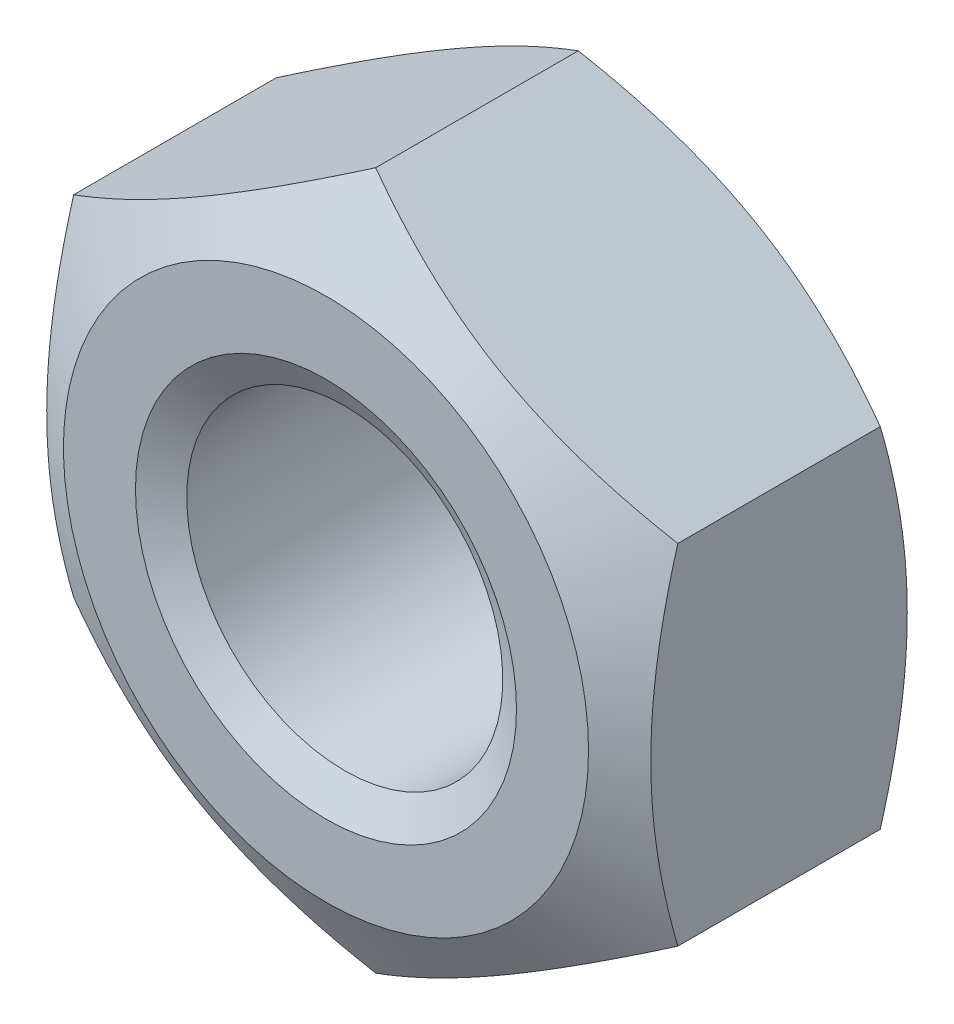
ISO-10303-21;
HEADER;
FILE_DESCRIPTION(('STEP AP214'),'2;1');
FILE_NAME('part.step','',(''),(''),'','','');
FILE_SCHEMA(('AUTOMOTIVE_DESIGN { 1 0 10303 214 1 1 1 1 }'));
ENDSEC;
DATA;
#1=APPLICATION_CONTEXT('core data for automotive mechanical design processes');
#2=APPLICATION_PROTOCOL_DEFINITION('international standard','automotive_design',2000,#1);
#3=PRODUCT_CONTEXT('',#1,'mechanical');
#4=PRODUCT('Part','Part','',(#3));
#5=PRODUCT_RELATED_PRODUCT_CATEGORY('part','',(#4));
#6=PRODUCT_DEFINITION_FORMATION('','',#4);
#7=PRODUCT_DEFINITION_CONTEXT('part definition',#1,'design');
#8=PRODUCT_DEFINITION('design','',#6,#7);
#9=PRODUCT_DEFINITION_SHAPE('','',#8);
#10=(LENGTH_UNIT() NAMED_UNIT(*) SI_UNIT(.MILLI.,.METRE.));
#11=(NAMED_UNIT(*) PLANE_ANGLE_UNIT() SI_UNIT($,.RADIAN.));
#12=(NAMED_UNIT(*) SI_UNIT($,.STERADIAN.) SOLID_ANGLE_UNIT());
#13=UNCERTAINTY_MEASURE_WITH_UNIT(LENGTH_MEASURE(1.E-05),#10,'distance_accuracy_value','');
#14=(GEOMETRIC_REPRESENTATION_CONTEXT(3) GLOBAL_UNCERTAINTY_ASSIGNED_CONTEXT((#13)) GLOBAL_UNIT_ASSIGNED_CONTEXT((#10,
#11,#12)) REPRESENTATION_CONTEXT('',''));
#15=CARTESIAN_POINT('',(0.,0.,0.));
#16=DIRECTION('',(0.,0.,1.));
#17=DIRECTION('',(1.,0.,0.));
#18=AXIS2_PLACEMENT_3D('',#15,#16,#17);
#19=CARTESIAN_POINT('',(0.,0.,0.));
#20=DIRECTION('',(0.,0.,1.));
#21=DIRECTION('',(1.,0.,0.));
#22=AXIS2_PLACEMENT_3D('',#19,#20,#21);
#23=PLANE('',#22);
#24=CARTESIAN_POINT('',(0.,0.,0.));
#25=DIRECTION('',(0.,0.,1.));
#26=DIRECTION('',(0.,-1.,0.));
#27=AXIS2_PLACEMENT_3D('',#24,#25,#26);
#28=CIRCLE('',#27,4.10000000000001);
#29=CARTESIAN_POINT('',(0.,-4.10000000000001,0.));
#30=VERTEX_POINT('',#29);
#31=EDGE_CURVE('E266',#30,#30,#28,.T.);
#32=ORIENTED_EDGE('',*,*,#31,.F.);
#33=EDGE_LOOP('',(#32));
#34=FACE_BOUND('',#33,.T.);
#35=CARTESIAN_POINT('',(0.,0.,0.));
#36=DIRECTION('',(0.,0.,1.));
#37=DIRECTION('',(1.,0.,0.));
#38=AXIS2_PLACEMENT_3D('',#35,#36,#37);
#39=CIRCLE('',#38,5.65);
#40=CARTESIAN_POINT('',(5.65,0.,0.));
#41=VERTEX_POINT('',#40);
#42=EDGE_CURVE('E225',#41,#41,#39,.T.);
#43=ORIENTED_EDGE('',*,*,#42,.T.);
#44=EDGE_LOOP('',(#43));
#45=FACE_BOUND('',#44,.T.);
#46=ADVANCED_FACE('F38',(#34,#45),#23,.T.);
#47=CARTESIAN_POINT('',(0.,0.,0.));
#48=DIRECTION('',(0.,0.,-1.));
#49=DIRECTION('',(-1.,0.,0.));
#50=AXIS2_PLACEMENT_3D('',#47,#48,#49);
#51=CONICAL_SURFACE('',#50,5.65,1.0471975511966);
#52=CARTESIAN_POINT('',(-6.50020000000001,3.75266127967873,-1.07137098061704));
#53=CARTESIAN_POINT('',(-6.35732254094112,3.8351516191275,-1.02375215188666));
#54=CARTESIAN_POINT('',(-6.21391236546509,3.91794952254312,-0.978294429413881));
#55=CARTESIAN_POINT('',(-5.92592736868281,4.08421773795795,-0.892296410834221));
#56=CARTESIAN_POINT('',(-5.78135207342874,4.16768832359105,-0.8517582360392));
#57=CARTESIAN_POINT('',(-5.34531134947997,4.41943655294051,-0.738318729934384));
#58=CARTESIAN_POINT('',(-5.05212471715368,4.58870793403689,-0.673795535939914));
#59=CARTESIAN_POINT('',(-4.61337625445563,4.84201947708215,-0.598134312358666));
#60=CARTESIAN_POINT('',(-4.46912536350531,4.92530276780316,-0.576580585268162));
#61=CARTESIAN_POINT('',(-4.17997178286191,5.09224566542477,-0.540438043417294));
#62=CARTESIAN_POINT('',(-4.03506915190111,5.17590523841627,-0.525848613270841));
#63=CARTESIAN_POINT('',(-3.74501222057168,5.34336968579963,-0.504006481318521));
#64=CARTESIAN_POINT('',(-3.59985839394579,5.427174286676,-0.496745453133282));
#65=CARTESIAN_POINT('',(-3.30942466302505,5.59485627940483,-0.489708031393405));
#66=CARTESIAN_POINT('',(-3.16414476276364,5.6787336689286,-0.489931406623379));
#67=CARTESIAN_POINT('',(-2.76612405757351,5.90853103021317,-0.500831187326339));
#68=CARTESIAN_POINT('',(-2.51351353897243,6.05437578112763,-0.519129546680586));
#69=CARTESIAN_POINT('',(-2.00997032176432,6.34509659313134,-0.577154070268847));
#70=CARTESIAN_POINT('',(-1.75903939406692,6.48997163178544,-0.616900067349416));
#71=CARTESIAN_POINT('',(-1.25448277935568,6.78127752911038,-0.71625363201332));
#72=CARTESIAN_POINT('',(-1.00092075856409,6.92767163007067,-0.776282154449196));
#73=CARTESIAN_POINT('',(-0.497578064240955,7.21827667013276,-0.912522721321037));
#74=CARTESIAN_POINT('',(-0.247790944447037,7.36249133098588,-0.988702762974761));
#75=CARTESIAN_POINT('',(0.000199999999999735,7.50566896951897,-1.07137098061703));
#76=B_SPLINE_CURVE_WITH_KNOTS('',3,(#52,#53,#54,#55,#56,#57,#58,#59,#60,#61,#62,#63,#64,#65,#66,
#67,#68,#69,#70,#71,#72,#73,#74,#75),.UNSPECIFIED.,.F.,.F.,(4,2,2,2,2,2,2,2,2,2,2,4),(0.,
0.515105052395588,1.03043143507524,2.06322554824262,2.56697389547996,3.07067772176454,
3.57380860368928,4.0769239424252,4.9527935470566,5.82947446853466,6.72559912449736,
7.61996451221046),.UNSPECIFIED.);
#77=CARTESIAN_POINT('',(-6.5,3.75277674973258,-1.07130431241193));
#78=VERTEX_POINT('',#77);
#79=CARTESIAN_POINT('',(0.,7.50555349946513,-1.07130431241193));
#80=VERTEX_POINT('',#79);
#81=EDGE_CURVE('E220',#78,#80,#76,.T.);
#82=ORIENTED_EDGE('',*,*,#81,.F.);
#83=CARTESIAN_POINT('',(-6.50000000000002,-9.88501104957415,-3.56837954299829));
#84=CARTESIAN_POINT('',(-6.50000000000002,-9.60267290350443,-3.432217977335));
#85=CARTESIAN_POINT('',(-6.50000000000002,-9.31966517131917,-3.29741992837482));
#86=CARTESIAN_POINT('',(-6.50000000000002,-8.75195359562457,-3.03132204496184));
#87=CARTESIAN_POINT('',(-6.50000000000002,-8.46724947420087,-2.90002280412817));
#88=CARTESIAN_POINT('',(-6.50000000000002,-7.89422527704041,-2.64099072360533));
#89=CARTESIAN_POINT('',(-6.50000000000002,-7.6058938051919,-2.51328300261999));
#90=CARTESIAN_POINT('',(-6.50000000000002,-7.02686778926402,-2.26336264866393));
#91=CARTESIAN_POINT('',(-6.50000000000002,-6.73617336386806,-2.14114974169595));
#92=CARTESIAN_POINT('',(-6.50000000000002,-6.1434030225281,-1.90019881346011));
#93=CARTESIAN_POINT('',(-6.50000000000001,-5.84124284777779,-1.78166688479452));
#94=CARTESIAN_POINT('',(-6.50000000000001,-5.23331686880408,-1.55405656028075));
#95=CARTESIAN_POINT('',(-6.50000000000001,-4.92755065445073,-1.44497925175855));
#96=CARTESIAN_POINT('',(-6.50000000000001,-4.31256079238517,-1.23928610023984));
#97=CARTESIAN_POINT('',(-6.50000000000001,-4.00334628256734,-1.14264324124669));
#98=CARTESIAN_POINT('',(-6.50000000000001,-3.38049972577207,-0.965045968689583));
#99=CARTESIAN_POINT('',(-6.50000000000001,-3.06686916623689,-0.884086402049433));
#100=CARTESIAN_POINT('',(-6.50000000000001,-2.4366401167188,-0.742287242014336));
#101=CARTESIAN_POINT('',(-6.50000000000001,-2.12006479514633,-0.681347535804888));
#102=CARTESIAN_POINT('',(-6.50000000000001,-1.64248174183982,-0.607688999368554));
#103=CARTESIAN_POINT('',(-6.50000000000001,-1.48282059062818,-0.586093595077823));
#104=CARTESIAN_POINT('',(-6.50000000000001,-1.16277367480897,-0.549247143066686));
#105=CARTESIAN_POINT('',(-6.50000000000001,-1.00238798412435,-0.533995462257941));
#106=CARTESIAN_POINT('',(-6.50000000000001,-0.683113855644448,-0.510321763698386));
#107=CARTESIAN_POINT('',(-6.50000000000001,-0.524231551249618,-0.501817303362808));
#108=CARTESIAN_POINT('',(-6.50000000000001,-0.206250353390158,-0.49151790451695));
#109=CARTESIAN_POINT('',(-6.50000000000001,-0.0471514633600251,-0.489722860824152));
#110=CARTESIAN_POINT('',(-6.50000000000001,0.270981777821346,-0.492885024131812));
#111=CARTESIAN_POINT('',(-6.50000000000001,0.430016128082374,-0.497842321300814));
#112=CARTESIAN_POINT('',(-6.50000000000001,0.747741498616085,-0.51439211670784));
#113=CARTESIAN_POINT('',(-6.50000000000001,0.906432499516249,-0.525984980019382));
#114=CARTESIAN_POINT('',(-6.50000000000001,1.29391310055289,-0.562155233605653));
#115=CARTESIAN_POINT('',(-6.50000000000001,1.52238353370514,-0.590218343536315));
#116=CARTESIAN_POINT('',(-6.50000000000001,1.97748684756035,-0.658520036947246));
#117=CARTESIAN_POINT('',(-6.50000000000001,2.20411944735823,-0.698760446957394));
#118=CARTESIAN_POINT('',(-6.50000000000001,2.88108028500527,-0.835601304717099));
#119=CARTESIAN_POINT('',(-6.50000000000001,3.32819122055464,-0.948291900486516));
#120=CARTESIAN_POINT('',(-6.50000000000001,3.99654941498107,-1.14191658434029));
#121=CARTESIAN_POINT('',(-6.50000000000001,4.22130458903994,-1.21142333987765));
#122=CARTESIAN_POINT('',(-6.50000000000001,4.66863001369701,-1.35720683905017));
#123=CARTESIAN_POINT('',(-6.50000000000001,4.89120025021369,-1.43348362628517));
#124=CARTESIAN_POINT('',(-6.50000000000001,5.33423505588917,-1.59162107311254));
#125=CARTESIAN_POINT('',(-6.5,5.55470038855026,-1.67347961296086));
#126=CARTESIAN_POINT('',(-6.5,5.99383484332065,-1.84186249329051));
#127=CARTESIAN_POINT('',(-6.5,6.21250398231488,-1.92838678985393));
#128=CARTESIAN_POINT('',(-6.5,6.71023613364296,-2.13048562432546));
#129=CARTESIAN_POINT('',(-6.5,6.98878541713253,-2.24732271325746));
#130=CARTESIAN_POINT('',(-6.5,7.54369190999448,-2.48610412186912));
#131=CARTESIAN_POINT('',(-6.5,7.82004901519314,-2.60804868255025));
#132=CARTESIAN_POINT('',(-6.5,8.37095551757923,-2.85606282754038));
#133=CARTESIAN_POINT('',(-6.5,8.64550461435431,-2.98213307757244));
#134=CARTESIAN_POINT('',(-6.5,9.19304534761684,-3.23761606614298));
#135=CARTESIAN_POINT('',(-6.5,9.46603695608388,-3.36702886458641));
#136=CARTESIAN_POINT('',(-6.5,10.2835096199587,-3.75956855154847));
#137=CARTESIAN_POINT('',(-6.5,10.8260256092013,-4.02678573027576));
#138=CARTESIAN_POINT('',(-6.5,11.9072962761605,-4.56872328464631));
#139=CARTESIAN_POINT('',(-6.5,12.4460508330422,-4.84344389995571));
#140=CARTESIAN_POINT('',(-6.5,13.2311434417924,-5.24876750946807));
#141=CARTESIAN_POINT('',(-6.5,13.4785832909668,-5.37724244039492));
#142=CARTESIAN_POINT('',(-6.5,13.9729354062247,-5.6351936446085));
#143=CARTESIAN_POINT('',(-6.5,14.219847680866,-5.76466990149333));
#144=CARTESIAN_POINT('',(-6.5,14.959914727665,-6.15441208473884));
#145=CARTESIAN_POINT('',(-6.5,15.4523825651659,-6.4159825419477));
#146=CARTESIAN_POINT('',(-6.49999999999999,16.4348369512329,-6.94123007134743));
#147=CARTESIAN_POINT('',(-6.49999999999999,16.9248265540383,-7.20490144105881));
#148=CARTESIAN_POINT('',(-6.49999999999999,17.9036341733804,-7.73435554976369));
#149=CARTESIAN_POINT('',(-6.49999999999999,18.3924522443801,-8.00013818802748));
#150=CARTESIAN_POINT('',(-6.49999999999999,18.8808336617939,-8.26671592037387));
#151=B_SPLINE_CURVE_WITH_KNOTS('',3,(#83,#84,#85,#86,#87,#88,#89,#90,#91,#92,#93,#94,#95,#96,
#97,#98,#99,#100,#101,#102,#103,#104,#105,#106,#107,#108,#109,#110,#111,#112,#113,#114,#115,
#116,#117,#118,#119,#120,#121,#122,#123,#124,#125,#126,#127,#128,#129,#130,#131,#132,#133,#134,
#135,#136,#137,#138,#139,#140,#141,#142,#143,#144,#145,#146,#147,#148,#149,#150),.UNSPECIFIED.,
.F.,.F.,(4,2,2,2,2,2,2,2,2,2,2,2,2,2,2,2,2,2,2,2,2,2,2,2,2,2,2,2,2,2,2,2,2,4),(0.,
0.940381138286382,1.88092082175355,2.82691871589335,3.7728693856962,4.74647944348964,
5.72020132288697,6.69177055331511,7.66302001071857,8.62933589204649,9.11257459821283,
9.59576506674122,10.0729564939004,10.5501404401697,11.0273307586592,11.5045473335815,
12.1947157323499,12.8849877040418,14.2663735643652,14.9720931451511,15.6778172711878,
16.3832748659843,17.0887258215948,17.994840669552,18.9009983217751,19.8073029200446,
20.7136237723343,22.5277913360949,24.3420169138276,25.17843035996,26.0148301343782,
27.6876876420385,29.3569670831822,31.0261673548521),.UNSPECIFIED.);
#152=CARTESIAN_POINT('',(-6.50000000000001,-3.75277674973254,-1.07130431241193));
#153=VERTEX_POINT('',#152);
#154=EDGE_CURVE('E188',#153,#78,#151,.T.);
#155=ORIENTED_EDGE('',*,*,#154,.F.);
#156=CARTESIAN_POINT('',(0.000199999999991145,-7.50566896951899,-1.07137098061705));
#157=CARTESIAN_POINT('',(-0.14267745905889,-7.42317863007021,-1.02375215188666));
#158=CARTESIAN_POINT('',(-0.286087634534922,-7.34038072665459,-0.978294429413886));
#159=CARTESIAN_POINT('',(-0.574072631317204,-7.17411251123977,-0.892296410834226));
#160=CARTESIAN_POINT('',(-0.718647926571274,-7.09064192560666,-0.851758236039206));
#161=CARTESIAN_POINT('',(-1.15468865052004,-6.8388936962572,-0.73831872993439));
#162=CARTESIAN_POINT('',(-1.44787528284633,-6.66962231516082,-0.673795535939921));
#163=CARTESIAN_POINT('',(-1.88662374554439,-6.41631077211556,-0.598134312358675));
#164=CARTESIAN_POINT('',(-2.0308746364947,-6.33302748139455,-0.576580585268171));
#165=CARTESIAN_POINT('',(-2.3200282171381,-6.16608458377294,-0.540438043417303));
#166=CARTESIAN_POINT('',(-2.4649308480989,-6.08242501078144,-0.525848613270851));
#167=CARTESIAN_POINT('',(-2.75498777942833,-5.91496056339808,-0.504006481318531));
#168=CARTESIAN_POINT('',(-2.90014160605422,-5.83115596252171,-0.496745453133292));
#169=CARTESIAN_POINT('',(-3.19057533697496,-5.66347396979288,-0.489708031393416));
#170=CARTESIAN_POINT('',(-3.33585523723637,-5.57959658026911,-0.48993140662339));
#171=CARTESIAN_POINT('',(-3.73387594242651,-5.34979921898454,-0.500831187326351));
#172=CARTESIAN_POINT('',(-3.98648646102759,-5.20395446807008,-0.519129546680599));
#173=CARTESIAN_POINT('',(-4.49002967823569,-4.91323365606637,-0.57715407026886));
#174=CARTESIAN_POINT('',(-4.7409606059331,-4.76835861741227,-0.616900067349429));
#175=CARTESIAN_POINT('',(-5.24551722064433,-4.47705272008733,-0.716253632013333));
#176=CARTESIAN_POINT('',(-5.49907924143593,-4.33065861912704,-0.77628215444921));
#177=CARTESIAN_POINT('',(-6.00242193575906,-4.04005357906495,-0.912522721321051));
#178=CARTESIAN_POINT('',(-6.25220905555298,-3.89583891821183,-0.988702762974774));
#179=CARTESIAN_POINT('',(-6.50020000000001,-3.75266127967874,-1.07137098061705));
#180=B_SPLINE_CURVE_WITH_KNOTS('',3,(#156,#157,#158,#159,#160,#161,#162,#163,#164,#165,#166,
#167,#168,#169,#170,#171,#172,#173,#174,#175,#176,#177,#178,#179),.UNSPECIFIED.,.F.,.F.,(4,2,2,
2,2,2,2,2,2,2,2,4),(0.,0.515105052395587,1.03043143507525,2.06322554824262,2.56697389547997,
3.07067772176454,3.57380860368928,4.0769239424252,4.9527935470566,5.82947446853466,
6.72559912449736,7.61996451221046),.UNSPECIFIED.);
#181=CARTESIAN_POINT('',(0.,-7.50555349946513,-1.07130431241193));
#182=VERTEX_POINT('',#181);
#183=EDGE_CURVE('E180',#182,#153,#180,.T.);
#184=ORIENTED_EDGE('',*,*,#183,.F.);
#185=CARTESIAN_POINT('',(6.50019999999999,-3.75266127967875,-1.07137098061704));
#186=CARTESIAN_POINT('',(6.35732254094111,-3.83515161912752,-1.02375215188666));
#187=CARTESIAN_POINT('',(6.21391236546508,-3.91794952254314,-0.978294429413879));
#188=CARTESIAN_POINT('',(5.9259273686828,-4.08421773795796,-0.89229641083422));
#189=CARTESIAN_POINT('',(5.78135207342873,-4.16768832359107,-0.8517582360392));
#190=CARTESIAN_POINT('',(5.34531134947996,-4.41943655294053,-0.738318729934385));
#191=CARTESIAN_POINT('',(5.05212471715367,-4.58870793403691,-0.673795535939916));
#192=CARTESIAN_POINT('',(4.61337625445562,-4.84201947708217,-0.598134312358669));
#193=CARTESIAN_POINT('',(4.4691253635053,-4.92530276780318,-0.576580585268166));
#194=CARTESIAN_POINT('',(4.1799717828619,-5.09224566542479,-0.540438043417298));
#195=CARTESIAN_POINT('',(4.0350691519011,-5.17590523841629,-0.525848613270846));
#196=CARTESIAN_POINT('',(3.74501222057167,-5.34336968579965,-0.504006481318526));
#197=CARTESIAN_POINT('',(3.59985839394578,-5.42717428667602,-0.496745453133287));
#198=CARTESIAN_POINT('',(3.30942466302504,-5.59485627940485,-0.489708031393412));
#199=CARTESIAN_POINT('',(3.16414476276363,-5.67873366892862,-0.489931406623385));
#200=CARTESIAN_POINT('',(2.7661240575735,-5.90853103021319,-0.500831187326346));
#201=CARTESIAN_POINT('',(2.51351353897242,-6.05437578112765,-0.519129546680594));
#202=CARTESIAN_POINT('',(2.00997032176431,-6.34509659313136,-0.577154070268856));
#203=CARTESIAN_POINT('',(1.75903939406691,-6.48997163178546,-0.616900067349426));
#204=CARTESIAN_POINT('',(1.25448277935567,-6.7812775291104,-0.71625363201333));
#205=CARTESIAN_POINT('',(1.00092075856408,-6.92767163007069,-0.776282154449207));
#206=CARTESIAN_POINT('',(0.497578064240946,-7.21827667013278,-0.912522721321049));
#207=CARTESIAN_POINT('',(0.247790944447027,-7.3624913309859,-0.988702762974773));
#208=CARTESIAN_POINT('',(-0.000200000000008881,-7.50566896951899,-1.07137098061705));
#209=B_SPLINE_CURVE_WITH_KNOTS('',3,(#185,#186,#187,#188,#189,#190,#191,#192,#193,#194,#195,
#196,#197,#198,#199,#200,#201,#202,#203,#204,#205,#206,#207,#208),.UNSPECIFIED.,.F.,.F.,(4,2,2,
2,2,2,2,2,2,2,2,4),(0.,0.515105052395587,1.03043143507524,2.06322554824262,2.56697389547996,
3.07067772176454,3.57380860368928,4.0769239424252,4.9527935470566,5.82947446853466,
6.72559912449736,7.61996451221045),.UNSPECIFIED.);
#210=CARTESIAN_POINT('',(6.49999999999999,-3.75277674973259,-1.07130431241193));
#211=VERTEX_POINT('',#210);
#212=EDGE_CURVE('E96',#211,#182,#209,.T.);
#213=ORIENTED_EDGE('',*,*,#212,.F.);
#214=CARTESIAN_POINT('',(6.5,-9.88501104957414,-3.56837954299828));
#215=CARTESIAN_POINT('',(6.5,-9.60267290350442,-3.43221797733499));
#216=CARTESIAN_POINT('',(6.5,-9.31966517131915,-3.29741992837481));
#217=CARTESIAN_POINT('',(6.5,-8.75195359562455,-3.03132204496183));
#218=CARTESIAN_POINT('',(6.5,-8.46724947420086,-2.90002280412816));
#219=CARTESIAN_POINT('',(6.5,-7.8942252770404,-2.64099072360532));
#220=CARTESIAN_POINT('',(6.5,-7.60589380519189,-2.51328300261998));
#221=CARTESIAN_POINT('',(6.5,-7.02686778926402,-2.26336264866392));
#222=CARTESIAN_POINT('',(6.5,-6.73617336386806,-2.14114974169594));
#223=CARTESIAN_POINT('',(6.5,-6.1434030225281,-1.9001988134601));
#224=CARTESIAN_POINT('',(6.5,-5.84124284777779,-1.78166688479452));
#225=CARTESIAN_POINT('',(6.49999999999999,-5.23331686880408,-1.55405656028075));
#226=CARTESIAN_POINT('',(6.49999999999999,-4.92755065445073,-1.44497925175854));
#227=CARTESIAN_POINT('',(6.49999999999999,-4.31256079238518,-1.23928610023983));
#228=CARTESIAN_POINT('',(6.49999999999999,-4.00334628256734,-1.14264324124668));
#229=CARTESIAN_POINT('',(6.49999999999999,-3.38049972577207,-0.965045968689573));
#230=CARTESIAN_POINT('',(6.49999999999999,-3.06686916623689,-0.884086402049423));
#231=CARTESIAN_POINT('',(6.49999999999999,-2.4366401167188,-0.742287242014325));
#232=CARTESIAN_POINT('',(6.49999999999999,-2.12006479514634,-0.681347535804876));
#233=CARTESIAN_POINT('',(6.49999999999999,-1.64248174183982,-0.607688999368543));
#234=CARTESIAN_POINT('',(6.49999999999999,-1.48282059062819,-0.586093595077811));
#235=CARTESIAN_POINT('',(6.49999999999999,-1.16277367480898,-0.549247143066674));
#236=CARTESIAN_POINT('',(6.49999999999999,-1.00238798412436,-0.533995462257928));
#237=CARTESIAN_POINT('',(6.49999999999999,-0.683113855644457,-0.510321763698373));
#238=CARTESIAN_POINT('',(6.49999999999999,-0.524231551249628,-0.501817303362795));
#239=CARTESIAN_POINT('',(6.49999999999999,-0.206250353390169,-0.491517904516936));
#240=CARTESIAN_POINT('',(6.49999999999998,-0.0471514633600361,-0.489722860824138));
#241=CARTESIAN_POINT('',(6.49999999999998,0.270981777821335,-0.492885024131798));
#242=CARTESIAN_POINT('',(6.49999999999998,0.430016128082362,-0.4978423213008));
#243=CARTESIAN_POINT('',(6.49999999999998,0.747741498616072,-0.514392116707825));
#244=CARTESIAN_POINT('',(6.49999999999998,0.906432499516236,-0.525984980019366));
#245=CARTESIAN_POINT('',(6.49999999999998,1.29391310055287,-0.562155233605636));
#246=CARTESIAN_POINT('',(6.49999999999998,1.52238353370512,-0.590218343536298));
#247=CARTESIAN_POINT('',(6.49999999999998,1.97748684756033,-0.658520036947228));
#248=CARTESIAN_POINT('',(6.49999999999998,2.20411944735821,-0.698760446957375));
#249=CARTESIAN_POINT('',(6.49999999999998,2.88108028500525,-0.835601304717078));
#250=CARTESIAN_POINT('',(6.49999999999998,3.32819122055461,-0.948291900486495));
#251=CARTESIAN_POINT('',(6.49999999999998,3.99654941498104,-1.14191658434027));
#252=CARTESIAN_POINT('',(6.49999999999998,4.22130458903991,-1.21142333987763));
#253=CARTESIAN_POINT('',(6.49999999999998,4.66863001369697,-1.35720683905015));
#254=CARTESIAN_POINT('',(6.49999999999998,4.89120025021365,-1.43348362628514));
#255=CARTESIAN_POINT('',(6.49999999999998,5.33423505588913,-1.59162107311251));
#256=CARTESIAN_POINT('',(6.49999999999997,5.55470038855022,-1.67347961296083));
#257=CARTESIAN_POINT('',(6.49999999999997,5.99383484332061,-1.84186249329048));
#258=CARTESIAN_POINT('',(6.49999999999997,6.21250398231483,-1.9283867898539));
#259=CARTESIAN_POINT('',(6.49999999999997,6.71023613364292,-2.13048562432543));
#260=CARTESIAN_POINT('',(6.49999999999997,6.98878541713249,-2.24732271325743));
#261=CARTESIAN_POINT('',(6.49999999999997,7.54369190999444,-2.48610412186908));
#262=CARTESIAN_POINT('',(6.49999999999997,7.8200490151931,-2.60804868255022));
#263=CARTESIAN_POINT('',(6.49999999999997,8.37095551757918,-2.85606282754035));
#264=CARTESIAN_POINT('',(6.49999999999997,8.64550461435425,-2.98213307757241));
#265=CARTESIAN_POINT('',(6.49999999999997,9.19304534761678,-3.23761606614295));
#266=CARTESIAN_POINT('',(6.49999999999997,9.46603695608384,-3.36702886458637));
#267=CARTESIAN_POINT('',(6.49999999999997,10.2835096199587,-3.75956855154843));
#268=CARTESIAN_POINT('',(6.49999999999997,10.8260256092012,-4.02678573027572));
#269=CARTESIAN_POINT('',(6.49999999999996,11.9072962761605,-4.56872328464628));
#270=CARTESIAN_POINT('',(6.49999999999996,12.4460508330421,-4.84344389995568));
#271=CARTESIAN_POINT('',(6.49999999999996,13.2311434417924,-5.24876750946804));
#272=CARTESIAN_POINT('',(6.49999999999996,13.4785832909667,-5.37724244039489));
#273=CARTESIAN_POINT('',(6.49999999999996,13.9729354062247,-5.63519364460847));
#274=CARTESIAN_POINT('',(6.49999999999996,14.2198476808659,-5.7646699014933));
#275=CARTESIAN_POINT('',(6.49999999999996,14.959914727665,-6.1544120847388));
#276=CARTESIAN_POINT('',(6.49999999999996,15.4523825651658,-6.41598254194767));
#277=CARTESIAN_POINT('',(6.49999999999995,16.4348369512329,-6.9412300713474));
#278=CARTESIAN_POINT('',(6.49999999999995,16.9248265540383,-7.20490144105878));
#279=CARTESIAN_POINT('',(6.49999999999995,17.9036341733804,-7.73435554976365));
#280=CARTESIAN_POINT('',(6.49999999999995,18.3924522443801,-8.00013818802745));
#281=CARTESIAN_POINT('',(6.49999999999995,18.8808336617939,-8.26671592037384));
#282=B_SPLINE_CURVE_WITH_KNOTS('',3,(#214,#215,#216,#217,#218,#219,#220,#221,#222,#223,#224,
#225,#226,#227,#228,#229,#230,#231,#232,#233,#234,#235,#236,#237,#238,#239,#240,#241,#242,#243,
#244,#245,#246,#247,#248,#249,#250,#251,#252,#253,#254,#255,#256,#257,#258,#259,#260,#261,#262,
#263,#264,#265,#266,#267,#268,#269,#270,#271,#272,#273,#274,#275,#276,#277,#278,#279,#280,#281),
.UNSPECIFIED.,.F.,.F.,(4,2,2,2,2,2,2,2,2,2,2,2,2,2,2,2,2,2,2,2,2,2,2,2,2,2,2,2,2,2,2,2,2,4),(0.,
0.940381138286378,1.88092082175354,2.82691871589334,3.77286938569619,4.74647944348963,
5.72020132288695,6.69177055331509,7.66302001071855,8.62933589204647,9.11257459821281,
9.5957650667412,10.0729564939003,10.5501404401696,11.0273307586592,11.5045473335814,
12.1947157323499,12.8849877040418,14.2663735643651,14.9720931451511,15.6778172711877,
16.3832748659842,17.0887258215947,17.9948406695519,18.9009983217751,19.8073029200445,
20.7136237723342,22.5277913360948,24.3420169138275,25.1784303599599,26.0148301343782,
27.6876876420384,29.3569670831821,31.026167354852),.UNSPECIFIED.);
#283=CARTESIAN_POINT('',(6.49999999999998,3.7527767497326,-1.07130431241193));
#284=VERTEX_POINT('',#283);
#285=EDGE_CURVE('E92',#284,#211,#282,.F.);
#286=ORIENTED_EDGE('',*,*,#285,.F.);
#287=CARTESIAN_POINT('',(-0.000200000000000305,7.50566896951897,-1.07137098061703));
#288=CARTESIAN_POINT('',(0.142677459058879,7.42317863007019,-1.02375215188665));
#289=CARTESIAN_POINT('',(0.286087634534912,7.34038072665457,-0.978294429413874));
#290=CARTESIAN_POINT('',(0.574072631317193,7.17411251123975,-0.892296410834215));
#291=CARTESIAN_POINT('',(0.718647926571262,7.09064192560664,-0.851758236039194));
#292=CARTESIAN_POINT('',(1.15468865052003,6.83889369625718,-0.738318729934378));
#293=CARTESIAN_POINT('',(1.44787528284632,6.6696223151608,-0.673795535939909));
#294=CARTESIAN_POINT('',(1.88662374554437,6.41631077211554,-0.598134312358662));
#295=CARTESIAN_POINT('',(2.03087463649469,6.33302748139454,-0.576580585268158));
#296=CARTESIAN_POINT('',(2.32002821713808,6.16608458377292,-0.540438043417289));
#297=CARTESIAN_POINT('',(2.46493084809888,6.08242501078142,-0.525848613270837));
#298=CARTESIAN_POINT('',(2.75498777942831,5.91496056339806,-0.504006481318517));
#299=CARTESIAN_POINT('',(2.9001416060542,5.8311559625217,-0.496745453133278));
#300=CARTESIAN_POINT('',(3.19057533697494,5.66347396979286,-0.489708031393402));
#301=CARTESIAN_POINT('',(3.33585523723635,5.57959658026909,-0.489931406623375));
#302=CARTESIAN_POINT('',(3.73387594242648,5.34979921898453,-0.500831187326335));
#303=CARTESIAN_POINT('',(3.98648646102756,5.20395446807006,-0.519129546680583));
#304=CARTESIAN_POINT('',(4.49002967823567,4.91323365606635,-0.577154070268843));
#305=CARTESIAN_POINT('',(4.74096060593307,4.76835861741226,-0.616900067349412));
#306=CARTESIAN_POINT('',(5.24551722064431,4.47705272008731,-0.716253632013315));
#307=CARTESIAN_POINT('',(5.4990792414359,4.33065861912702,-0.776282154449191));
#308=CARTESIAN_POINT('',(6.00242193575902,4.04005357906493,-0.912522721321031));
#309=CARTESIAN_POINT('',(6.25220905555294,3.89583891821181,-0.988702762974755));
#310=CARTESIAN_POINT('',(6.50019999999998,3.75266127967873,-1.07137098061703));
#311=B_SPLINE_CURVE_WITH_KNOTS('',3,(#287,#288,#289,#290,#291,#292,#293,#294,#295,#296,#297,
#298,#299,#300,#301,#302,#303,#304,#305,#306,#307,#308,#309,#310),.UNSPECIFIED.,.F.,.F.,(4,2,2,
2,2,2,2,2,2,2,2,4),(0.,0.515105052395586,1.03043143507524,2.06322554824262,2.56697389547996,
3.07067772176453,3.57380860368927,4.07692394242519,4.95279354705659,5.82947446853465,
6.72559912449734,7.61996451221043),.UNSPECIFIED.);
#312=EDGE_CURVE('E64',#80,#284,#311,.T.);
#313=ORIENTED_EDGE('',*,*,#312,.F.);
#314=EDGE_LOOP('',(#82,#155,#184,#213,#286,#313));
#315=FACE_BOUND('',#314,.T.);
#316=ORIENTED_EDGE('',*,*,#42,.F.);
#317=EDGE_LOOP('',(#316));
#318=FACE_BOUND('',#317,.T.);
#319=ADVANCED_FACE('F93',(#315,#318),#51,.T.);
#320=CARTESIAN_POINT('',(6.49999999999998,3.75277674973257,-6.5));
#321=DIRECTION('',(0.500000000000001,0.866025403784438,0.));
#322=DIRECTION('',(-0.866025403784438,0.500000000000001,0.));
#323=AXIS2_PLACEMENT_3D('',#320,#321,#322);
#324=PLANE('',#323);
#325=DIRECTION('',(0.,0.,1.));
#326=VECTOR('',#325,1.);
#327=CARTESIAN_POINT('',(6.49999999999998,3.75277674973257,-6.5));
#328=LINE('',#327,#326);
#329=CARTESIAN_POINT('',(6.49999999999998,3.75277674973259,-5.42869568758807));
#330=VERTEX_POINT('',#329);
#331=EDGE_CURVE('E11',#330,#284,#328,.T.);
#332=ORIENTED_EDGE('',*,*,#331,.F.);
#333=CARTESIAN_POINT('',(6.50019999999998,3.75266127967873,-5.42862901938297));
#334=CARTESIAN_POINT('',(6.3573225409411,3.8351516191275,-5.47624784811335));
#335=CARTESIAN_POINT('',(6.21391236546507,3.91794952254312,-5.52170557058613));
#336=CARTESIAN_POINT('',(5.92592736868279,4.08421773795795,-5.60770358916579));
#337=CARTESIAN_POINT('',(5.78135207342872,4.16768832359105,-5.64824176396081));
#338=CARTESIAN_POINT('',(5.34531134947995,4.41943655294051,-5.76168127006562));
#339=CARTESIAN_POINT('',(5.05212471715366,4.58870793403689,-5.82620446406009));
#340=CARTESIAN_POINT('',(4.61337625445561,4.84201947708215,-5.90186568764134));
#341=CARTESIAN_POINT('',(4.46912536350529,4.92530276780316,-5.92341941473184));
#342=CARTESIAN_POINT('',(4.1799717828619,5.09224566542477,-5.95956195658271));
#343=CARTESIAN_POINT('',(4.0350691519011,5.17590523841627,-5.97415138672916));
#344=CARTESIAN_POINT('',(3.74501222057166,5.34336968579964,-5.99599351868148));
#345=CARTESIAN_POINT('',(3.59985839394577,5.427174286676,-6.00325454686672));
#346=CARTESIAN_POINT('',(3.30942466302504,5.59485627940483,-6.0102919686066));
#347=CARTESIAN_POINT('',(3.16414476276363,5.6787336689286,-6.01006859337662));
#348=CARTESIAN_POINT('',(2.76612405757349,5.90853103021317,-5.99916881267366));
#349=CARTESIAN_POINT('',(2.51351353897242,6.05437578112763,-5.98087045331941));
#350=CARTESIAN_POINT('',(2.00997032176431,6.34509659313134,-5.92284592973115));
#351=CARTESIAN_POINT('',(1.75903939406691,6.48997163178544,-5.88309993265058));
#352=CARTESIAN_POINT('',(1.25448277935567,6.78127752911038,-5.78374636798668));
#353=CARTESIAN_POINT('',(1.00092075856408,6.92767163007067,-5.7237178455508));
#354=CARTESIAN_POINT('',(0.497578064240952,7.21827667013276,-5.58747727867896));
#355=CARTESIAN_POINT('',(0.247790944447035,7.36249133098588,-5.51129723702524));
#356=CARTESIAN_POINT('',(-0.000200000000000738,7.50566896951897,-5.42862901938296));
#357=B_SPLINE_CURVE_WITH_KNOTS('',3,(#333,#334,#335,#336,#337,#338,#339,#340,#341,#342,#343,
#344,#345,#346,#347,#348,#349,#350,#351,#352,#353,#354,#355,#356),.UNSPECIFIED.,.F.,.F.,(4,2,2,
2,2,2,2,2,2,2,2,4),(0.,0.515105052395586,1.03043143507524,2.06322554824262,2.56697389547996,
3.07067772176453,3.57380860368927,4.07692394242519,4.95279354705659,5.82947446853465,
6.72559912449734,7.61996451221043),.UNSPECIFIED.);
#358=CARTESIAN_POINT('',(0.,7.50555349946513,-5.42869568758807));
#359=VERTEX_POINT('',#358);
#360=EDGE_CURVE('E112',#330,#359,#357,.T.);
#361=ORIENTED_EDGE('',*,*,#360,.T.);
#362=DIRECTION('',(0.,0.,1.));
#363=VECTOR('',#362,1.);
#364=CARTESIAN_POINT('',(0.,7.50555349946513,-6.5));
#365=LINE('',#364,#363);
#366=EDGE_CURVE('E43',#359,#80,#365,.T.);
#367=ORIENTED_EDGE('',*,*,#366,.T.);
#368=ORIENTED_EDGE('',*,*,#312,.T.);
#369=EDGE_LOOP('',(#332,#361,#367,#368));
#370=FACE_BOUND('',#369,.T.);
#371=ADVANCED_FACE('F40',(#370),#324,.T.);
#372=CARTESIAN_POINT('',(6.49999999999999,-3.75277674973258,-6.5));
#373=DIRECTION('',(1.,0.,0.));
#374=DIRECTION('',(0.,1.,0.));
#375=AXIS2_PLACEMENT_3D('',#372,#373,#374);
#376=PLANE('',#375);
#377=DIRECTION('',(0.,0.,1.));
#378=VECTOR('',#377,1.);
#379=CARTESIAN_POINT('',(6.49999999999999,-3.75277674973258,-6.5));
#380=LINE('',#379,#378);
#381=CARTESIAN_POINT('',(6.49999999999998,-3.7527767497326,-5.42869568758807));
#382=VERTEX_POINT('',#381);
#383=EDGE_CURVE('E48',#382,#211,#380,.T.);
#384=ORIENTED_EDGE('',*,*,#383,.F.);
#385=CARTESIAN_POINT('',(6.5,-9.88501104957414,-2.93162045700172));
#386=CARTESIAN_POINT('',(6.5,-9.60267290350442,-3.067782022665));
#387=CARTESIAN_POINT('',(6.5,-9.31966517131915,-3.20258007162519));
#388=CARTESIAN_POINT('',(6.5,-8.75195359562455,-3.46867795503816));
#389=CARTESIAN_POINT('',(6.5,-8.46724947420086,-3.59997719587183));
#390=CARTESIAN_POINT('',(6.5,-7.8942252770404,-3.85900927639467));
#391=CARTESIAN_POINT('',(6.5,-7.60589380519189,-3.98671699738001));
#392=CARTESIAN_POINT('',(6.5,-7.02686778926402,-4.23663735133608));
#393=CARTESIAN_POINT('',(6.5,-6.73617336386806,-4.35885025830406));
#394=CARTESIAN_POINT('',(6.5,-6.1434030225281,-4.59980118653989));
#395=CARTESIAN_POINT('',(6.5,-5.84124284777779,-4.71833311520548));
#396=CARTESIAN_POINT('',(6.49999999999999,-5.23331686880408,-4.94594343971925));
#397=CARTESIAN_POINT('',(6.49999999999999,-4.92755065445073,-5.05502074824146));
#398=CARTESIAN_POINT('',(6.49999999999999,-4.31256079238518,-5.26071389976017));
#399=CARTESIAN_POINT('',(6.49999999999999,-4.00334628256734,-5.35735675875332));
#400=CARTESIAN_POINT('',(6.49999999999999,-3.38049972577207,-5.53495403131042));
#401=CARTESIAN_POINT('',(6.49999999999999,-3.06686916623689,-5.61591359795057));
#402=CARTESIAN_POINT('',(6.49999999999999,-2.4366401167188,-5.75771275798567));
#403=CARTESIAN_POINT('',(6.49999999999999,-2.12006479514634,-5.81865246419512));
#404=CARTESIAN_POINT('',(6.49999999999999,-1.64248174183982,-5.89231100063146));
#405=CARTESIAN_POINT('',(6.49999999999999,-1.48282059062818,-5.91390640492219));
#406=CARTESIAN_POINT('',(6.49999999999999,-1.16277367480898,-5.95075285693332));
#407=CARTESIAN_POINT('',(6.49999999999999,-1.00238798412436,-5.96600453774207));
#408=CARTESIAN_POINT('',(6.49999999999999,-0.683113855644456,-5.98967823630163));
#409=CARTESIAN_POINT('',(6.49999999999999,-0.524231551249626,-5.9981826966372));
#410=CARTESIAN_POINT('',(6.49999999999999,-0.206250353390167,-6.00848209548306));
#411=CARTESIAN_POINT('',(6.49999999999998,-0.0471514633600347,-6.01027713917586));
#412=CARTESIAN_POINT('',(6.49999999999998,0.270981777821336,-6.0071149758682));
#413=CARTESIAN_POINT('',(6.49999999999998,0.430016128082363,-6.0021576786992));
#414=CARTESIAN_POINT('',(6.49999999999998,0.747741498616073,-5.98560788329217));
#415=CARTESIAN_POINT('',(6.49999999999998,0.906432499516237,-5.97401501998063));
#416=CARTESIAN_POINT('',(6.49999999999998,1.29391310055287,-5.93784476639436));
#417=CARTESIAN_POINT('',(6.49999999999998,1.52238353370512,-5.9097816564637));
#418=CARTESIAN_POINT('',(6.49999999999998,1.97748684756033,-5.84147996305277));
#419=CARTESIAN_POINT('',(6.49999999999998,2.20411944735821,-5.80123955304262));
#420=CARTESIAN_POINT('',(6.49999999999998,2.88108028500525,-5.66439869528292));
#421=CARTESIAN_POINT('',(6.49999999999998,3.32819122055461,-5.5517080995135));
#422=CARTESIAN_POINT('',(6.49999999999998,3.99654941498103,-5.35808341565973));
#423=CARTESIAN_POINT('',(6.49999999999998,4.2213045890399,-5.28857666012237));
#424=CARTESIAN_POINT('',(6.49999999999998,4.66863001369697,-5.14279316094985));
#425=CARTESIAN_POINT('',(6.49999999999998,4.89120025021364,-5.06651637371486));
#426=CARTESIAN_POINT('',(6.49999999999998,5.33423505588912,-4.90837892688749));
#427=CARTESIAN_POINT('',(6.49999999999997,5.55470038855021,-4.82652038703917));
#428=CARTESIAN_POINT('',(6.49999999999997,5.9938348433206,-4.65813750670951));
#429=CARTESIAN_POINT('',(6.49999999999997,6.21250398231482,-4.5716132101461));
#430=CARTESIAN_POINT('',(6.49999999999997,6.71023613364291,-4.36951437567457));
#431=CARTESIAN_POINT('',(6.49999999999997,6.98878541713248,-4.25267728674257));
#432=CARTESIAN_POINT('',(6.49999999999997,7.54369190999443,-4.01389587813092));
#433=CARTESIAN_POINT('',(6.49999999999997,7.82004901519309,-3.89195131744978));
#434=CARTESIAN_POINT('',(6.49999999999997,8.37095551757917,-3.64393717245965));
#435=CARTESIAN_POINT('',(6.49999999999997,8.64550461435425,-3.51786692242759));
#436=CARTESIAN_POINT('',(6.49999999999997,9.19304534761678,-3.26238393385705));
#437=CARTESIAN_POINT('',(6.49999999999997,9.46603695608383,-3.13297113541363));
#438=CARTESIAN_POINT('',(6.49999999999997,10.2835096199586,-2.74043144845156));
#439=CARTESIAN_POINT('',(6.49999999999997,10.8260256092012,-2.47321426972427));
#440=CARTESIAN_POINT('',(6.49999999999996,11.9072962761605,-1.93127671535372));
#441=CARTESIAN_POINT('',(6.49999999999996,12.4460508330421,-1.65655610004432));
#442=CARTESIAN_POINT('',(6.49999999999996,13.2311434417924,-1.25123249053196));
#443=CARTESIAN_POINT('',(6.49999999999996,13.4785832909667,-1.12275755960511));
#444=CARTESIAN_POINT('',(6.49999999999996,13.9729354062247,-0.864806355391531));
#445=CARTESIAN_POINT('',(6.49999999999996,14.2198476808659,-0.735330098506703));
#446=CARTESIAN_POINT('',(6.49999999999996,14.9599147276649,-0.345587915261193));
#447=CARTESIAN_POINT('',(6.49999999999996,15.4523825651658,-0.0840174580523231));
#448=CARTESIAN_POINT('',(6.49999999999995,16.4348369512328,0.441230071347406));
#449=CARTESIAN_POINT('',(6.49999999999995,16.9248265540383,0.704901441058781));
#450=CARTESIAN_POINT('',(6.49999999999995,17.9036341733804,1.23435554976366));
#451=CARTESIAN_POINT('',(6.49999999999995,18.3924522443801,1.50013818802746));
#452=CARTESIAN_POINT('',(6.49999999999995,18.8808336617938,1.76671592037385));
#453=B_SPLINE_CURVE_WITH_KNOTS('',3,(#385,#386,#387,#388,#389,#390,#391,#392,#393,#394,#395,
#396,#397,#398,#399,#400,#401,#402,#403,#404,#405,#406,#407,#408,#409,#410,#411,#412,#413,#414,
#415,#416,#417,#418,#419,#420,#421,#422,#423,#424,#425,#426,#427,#428,#429,#430,#431,#432,#433,
#434,#435,#436,#437,#438,#439,#440,#441,#442,#443,#444,#445,#446,#447,#448,#449,#450,#451,#452),
.UNSPECIFIED.,.F.,.F.,(4,2,2,2,2,2,2,2,2,2,2,2,2,2,2,2,2,2,2,2,2,2,2,2,2,2,2,2,2,2,2,2,2,4),(0.,
0.940381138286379,1.88092082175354,2.82691871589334,3.77286938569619,4.74647944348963,
5.72020132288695,6.69177055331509,7.66302001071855,8.62933589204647,9.11257459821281,
9.5957650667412,10.0729564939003,10.5501404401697,11.0273307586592,11.5045473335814,
12.1947157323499,12.8849877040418,14.2663735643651,14.9720931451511,15.6778172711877,
16.3832748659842,17.0887258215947,17.9948406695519,18.9009983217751,19.8073029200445,
20.7136237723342,22.5277913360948,24.3420169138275,25.1784303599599,26.0148301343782,
27.6876876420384,29.3569670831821,31.026167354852),.UNSPECIFIED.);
#454=EDGE_CURVE('E110',#382,#330,#453,.T.);
#455=ORIENTED_EDGE('',*,*,#454,.T.);
#456=ORIENTED_EDGE('',*,*,#331,.T.);
#457=ORIENTED_EDGE('',*,*,#285,.T.);
#458=EDGE_LOOP('',(#384,#455,#456,#457));
#459=FACE_BOUND('',#458,.T.);
#460=ADVANCED_FACE('F109',(#459),#376,.T.);
#461=CARTESIAN_POINT('',(0.,-7.50555349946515,-6.5));
#462=DIRECTION('',(0.5,-0.866025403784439,0.));
#463=DIRECTION('',(0.866025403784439,0.5,0.));
#464=AXIS2_PLACEMENT_3D('',#461,#462,#463);
#465=PLANE('',#464);
#466=DIRECTION('',(0.,0.,1.));
#467=VECTOR('',#466,1.);
#468=CARTESIAN_POINT('',(0.,-7.50555349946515,-6.5));
#469=LINE('',#468,#467);
#470=CARTESIAN_POINT('',(0.,-7.50555349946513,-5.42869568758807));
#471=VERTEX_POINT('',#470);
#472=EDGE_CURVE('E209',#471,#182,#469,.T.);
#473=ORIENTED_EDGE('',*,*,#472,.F.);
#474=CARTESIAN_POINT('',(-0.000200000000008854,-7.50566896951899,-5.42862901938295));
#475=CARTESIAN_POINT('',(0.142677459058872,-7.42317863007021,-5.47624784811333));
#476=CARTESIAN_POINT('',(0.286087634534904,-7.34038072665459,-5.52170557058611));
#477=CARTESIAN_POINT('',(0.574072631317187,-7.17411251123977,-5.60770358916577));
#478=CARTESIAN_POINT('',(0.718647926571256,-7.09064192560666,-5.64824176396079));
#479=CARTESIAN_POINT('',(1.15468865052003,-6.8388936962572,-5.76168127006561));
#480=CARTESIAN_POINT('',(1.44787528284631,-6.66962231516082,-5.82620446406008));
#481=CARTESIAN_POINT('',(1.88662374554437,-6.41631077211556,-5.90186568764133));
#482=CARTESIAN_POINT('',(2.03087463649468,-6.33302748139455,-5.92341941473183));
#483=CARTESIAN_POINT('',(2.32002821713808,-6.16608458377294,-5.9595619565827));
#484=CARTESIAN_POINT('',(2.46493084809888,-6.08242501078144,-5.97415138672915));
#485=CARTESIAN_POINT('',(2.75498777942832,-5.91496056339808,-5.99599351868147));
#486=CARTESIAN_POINT('',(2.90014160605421,-5.83115596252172,-6.00325454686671));
#487=CARTESIAN_POINT('',(3.19057533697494,-5.66347396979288,-6.01029196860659));
#488=CARTESIAN_POINT('',(3.33585523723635,-5.57959658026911,-6.01006859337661));
#489=CARTESIAN_POINT('',(3.73387594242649,-5.34979921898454,-5.99916881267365));
#490=CARTESIAN_POINT('',(3.98648646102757,-5.20395446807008,-5.98087045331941));
#491=CARTESIAN_POINT('',(4.49002967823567,-4.91323365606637,-5.92284592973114));
#492=CARTESIAN_POINT('',(4.74096060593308,-4.76835861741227,-5.88309993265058));
#493=CARTESIAN_POINT('',(5.24551722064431,-4.47705272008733,-5.78374636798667));
#494=CARTESIAN_POINT('',(5.49907924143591,-4.33065861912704,-5.72371784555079));
#495=CARTESIAN_POINT('',(6.00242193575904,-4.04005357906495,-5.58747727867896));
#496=CARTESIAN_POINT('',(6.25220905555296,-3.89583891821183,-5.51129723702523));
#497=CARTESIAN_POINT('',(6.50019999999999,-3.75266127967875,-5.42862901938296));
#498=B_SPLINE_CURVE_WITH_KNOTS('',3,(#474,#475,#476,#477,#478,#479,#480,#481,#482,#483,#484,
#485,#486,#487,#488,#489,#490,#491,#492,#493,#494,#495,#496,#497),.UNSPECIFIED.,.F.,.F.,(4,2,2,
2,2,2,2,2,2,2,2,4),(0.,0.515105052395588,1.03043143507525,2.06322554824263,2.56697389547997,
3.07067772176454,3.57380860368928,4.0769239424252,4.9527935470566,5.82947446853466,
6.72559912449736,7.61996451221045),.UNSPECIFIED.);
#499=EDGE_CURVE('E113',#471,#382,#498,.T.);
#500=ORIENTED_EDGE('',*,*,#499,.T.);
#501=ORIENTED_EDGE('',*,*,#383,.T.);
#502=ORIENTED_EDGE('',*,*,#212,.T.);
#503=EDGE_LOOP('',(#473,#500,#501,#502));
#504=FACE_BOUND('',#503,.T.);
#505=ADVANCED_FACE('F174',(#504),#465,.T.);
#506=CARTESIAN_POINT('',(-6.50000000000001,-3.75277674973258,-6.5));
#507=DIRECTION('',(-0.5,-0.866025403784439,0.));
#508=DIRECTION('',(0.866025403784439,-0.5,0.));
#509=AXIS2_PLACEMENT_3D('',#506,#507,#508);
#510=PLANE('',#509);
#511=DIRECTION('',(0.,0.,1.));
#512=VECTOR('',#511,1.);
#513=CARTESIAN_POINT('',(-6.50000000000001,-3.75277674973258,-6.5));
#514=LINE('',#513,#512);
#515=CARTESIAN_POINT('',(-6.50000000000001,-3.75277674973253,-5.42869568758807));
#516=VERTEX_POINT('',#515);
#517=EDGE_CURVE('E212',#516,#153,#514,.T.);
#518=ORIENTED_EDGE('',*,*,#517,.F.);
#519=CARTESIAN_POINT('',(-6.50020000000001,-3.75266127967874,-5.42862901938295));
#520=CARTESIAN_POINT('',(-6.35732254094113,-3.83515161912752,-5.47624784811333));
#521=CARTESIAN_POINT('',(-6.2139123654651,-3.91794952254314,-5.52170557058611));
#522=CARTESIAN_POINT('',(-5.92592736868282,-4.08421773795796,-5.60770358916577));
#523=CARTESIAN_POINT('',(-5.78135207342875,-4.16768832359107,-5.64824176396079));
#524=CARTESIAN_POINT('',(-5.34531134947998,-4.41943655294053,-5.76168127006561));
#525=CARTESIAN_POINT('',(-5.05212471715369,-4.58870793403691,-5.82620446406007));
#526=CARTESIAN_POINT('',(-4.61337625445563,-4.84201947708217,-5.90186568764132));
#527=CARTESIAN_POINT('',(-4.46912536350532,-4.92530276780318,-5.92341941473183));
#528=CARTESIAN_POINT('',(-4.17997178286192,-5.09224566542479,-5.95956195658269));
#529=CARTESIAN_POINT('',(-4.03506915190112,-5.17590523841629,-5.97415138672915));
#530=CARTESIAN_POINT('',(-3.74501222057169,-5.34336968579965,-5.99599351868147));
#531=CARTESIAN_POINT('',(-3.5998583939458,-5.42717428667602,-6.0032545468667));
#532=CARTESIAN_POINT('',(-3.30942466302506,-5.59485627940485,-6.01029196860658));
#533=CARTESIAN_POINT('',(-3.16414476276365,-5.67873366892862,-6.01006859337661));
#534=CARTESIAN_POINT('',(-2.76612405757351,-5.90853103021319,-5.99916881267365));
#535=CARTESIAN_POINT('',(-2.51351353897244,-6.05437578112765,-5.9808704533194));
#536=CARTESIAN_POINT('',(-2.00997032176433,-6.34509659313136,-5.92284592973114));
#537=CARTESIAN_POINT('',(-1.75903939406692,-6.48997163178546,-5.88309993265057));
#538=CARTESIAN_POINT('',(-1.25448277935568,-6.7812775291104,-5.78374636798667));
#539=CARTESIAN_POINT('',(-1.00092075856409,-6.92767163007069,-5.72371784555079));
#540=CARTESIAN_POINT('',(-0.497578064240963,-7.21827667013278,-5.58747727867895));
#541=CARTESIAN_POINT('',(-0.247790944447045,-7.3624913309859,-5.51129723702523));
#542=CARTESIAN_POINT('',(0.000199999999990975,-7.50566896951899,-5.42862901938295));
#543=B_SPLINE_CURVE_WITH_KNOTS('',3,(#519,#520,#521,#522,#523,#524,#525,#526,#527,#528,#529,
#530,#531,#532,#533,#534,#535,#536,#537,#538,#539,#540,#541,#542),.UNSPECIFIED.,.F.,.F.,(4,2,2,
2,2,2,2,2,2,2,2,4),(0.,0.515105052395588,1.03043143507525,2.06322554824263,2.56697389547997,
3.07067772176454,3.57380860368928,4.07692394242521,4.95279354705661,5.82947446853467,
6.72559912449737,7.61996451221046),.UNSPECIFIED.);
#544=EDGE_CURVE('E116',#516,#471,#543,.T.);
#545=ORIENTED_EDGE('',*,*,#544,.T.);
#546=ORIENTED_EDGE('',*,*,#472,.T.);
#547=ORIENTED_EDGE('',*,*,#183,.T.);
#548=EDGE_LOOP('',(#518,#545,#546,#547));
#549=FACE_BOUND('',#548,.T.);
#550=ADVANCED_FACE('F170',(#549),#510,.T.);
#551=CARTESIAN_POINT('',(-6.50000000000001,3.75277674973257,-6.5));
#552=DIRECTION('',(-1.,0.,0.));
#553=DIRECTION('',(0.,-1.,0.));
#554=AXIS2_PLACEMENT_3D('',#551,#552,#553);
#555=PLANE('',#554);
#556=DIRECTION('',(0.,0.,1.));
#557=VECTOR('',#556,1.);
#558=CARTESIAN_POINT('',(-6.50000000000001,3.75277674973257,-6.5));
#559=LINE('',#558,#557);
#560=CARTESIAN_POINT('',(-6.50000000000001,3.75277674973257,-5.42869568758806));
#561=VERTEX_POINT('',#560);
#562=EDGE_CURVE('E215',#561,#78,#559,.T.);
#563=ORIENTED_EDGE('',*,*,#562,.F.);
#564=CARTESIAN_POINT('',(-6.50000000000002,-9.88501104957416,-2.9316204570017));
#565=CARTESIAN_POINT('',(-6.50000000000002,-9.60267290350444,-3.06778202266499));
#566=CARTESIAN_POINT('',(-6.50000000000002,-9.31966517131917,-3.20258007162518));
#567=CARTESIAN_POINT('',(-6.50000000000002,-8.75195359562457,-3.46867795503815));
#568=CARTESIAN_POINT('',(-6.50000000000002,-8.46724947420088,-3.59997719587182));
#569=CARTESIAN_POINT('',(-6.50000000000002,-7.89422527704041,-3.85900927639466));
#570=CARTESIAN_POINT('',(-6.50000000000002,-7.6058938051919,-3.98671699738));
#571=CARTESIAN_POINT('',(-6.50000000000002,-7.02686778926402,-4.23663735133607));
#572=CARTESIAN_POINT('',(-6.50000000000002,-6.73617336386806,-4.35885025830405));
#573=CARTESIAN_POINT('',(-6.50000000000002,-6.1434030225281,-4.59980118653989));
#574=CARTESIAN_POINT('',(-6.50000000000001,-5.84124284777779,-4.71833311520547));
#575=CARTESIAN_POINT('',(-6.50000000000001,-5.23331686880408,-4.94594343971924));
#576=CARTESIAN_POINT('',(-6.50000000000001,-4.92755065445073,-5.05502074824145));
#577=CARTESIAN_POINT('',(-6.50000000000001,-4.31256079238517,-5.26071389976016));
#578=CARTESIAN_POINT('',(-6.50000000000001,-4.00334628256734,-5.35735675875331));
#579=CARTESIAN_POINT('',(-6.50000000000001,-3.38049972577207,-5.53495403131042));
#580=CARTESIAN_POINT('',(-6.50000000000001,-3.06686916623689,-5.61591359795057));
#581=CARTESIAN_POINT('',(-6.50000000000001,-2.4366401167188,-5.75771275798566));
#582=CARTESIAN_POINT('',(-6.50000000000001,-2.12006479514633,-5.81865246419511));
#583=CARTESIAN_POINT('',(-6.50000000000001,-1.64248174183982,-5.89231100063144));
#584=CARTESIAN_POINT('',(-6.50000000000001,-1.48282059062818,-5.91390640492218));
#585=CARTESIAN_POINT('',(-6.50000000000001,-1.16277367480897,-5.95075285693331));
#586=CARTESIAN_POINT('',(-6.50000000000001,-1.00238798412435,-5.96600453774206));
#587=CARTESIAN_POINT('',(-6.50000000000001,-0.683113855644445,-5.98967823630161));
#588=CARTESIAN_POINT('',(-6.50000000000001,-0.524231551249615,-5.99818269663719));
#589=CARTESIAN_POINT('',(-6.50000000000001,-0.206250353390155,-6.00848209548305));
#590=CARTESIAN_POINT('',(-6.50000000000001,-0.0471514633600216,-6.01027713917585));
#591=CARTESIAN_POINT('',(-6.50000000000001,0.270981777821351,-6.00711497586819));
#592=CARTESIAN_POINT('',(-6.50000000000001,0.430016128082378,-6.00215767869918));
#593=CARTESIAN_POINT('',(-6.50000000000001,0.747741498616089,-5.98560788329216));
#594=CARTESIAN_POINT('',(-6.50000000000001,0.906432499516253,-5.97401501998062));
#595=CARTESIAN_POINT('',(-6.50000000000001,1.29391310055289,-5.93784476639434));
#596=CARTESIAN_POINT('',(-6.50000000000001,1.52238353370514,-5.90978165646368));
#597=CARTESIAN_POINT('',(-6.50000000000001,1.97748684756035,-5.84147996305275));
#598=CARTESIAN_POINT('',(-6.50000000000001,2.20411944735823,-5.8012395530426));
#599=CARTESIAN_POINT('',(-6.50000000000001,2.88108028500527,-5.6643986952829));
#600=CARTESIAN_POINT('',(-6.50000000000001,3.32819122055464,-5.55170809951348));
#601=CARTESIAN_POINT('',(-6.50000000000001,3.99654941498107,-5.35808341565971));
#602=CARTESIAN_POINT('',(-6.50000000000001,4.22130458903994,-5.28857666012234));
#603=CARTESIAN_POINT('',(-6.50000000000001,4.66863001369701,-5.14279316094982));
#604=CARTESIAN_POINT('',(-6.50000000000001,4.89120025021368,-5.06651637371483));
#605=CARTESIAN_POINT('',(-6.50000000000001,5.33423505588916,-4.90837892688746));
#606=CARTESIAN_POINT('',(-6.5,5.55470038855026,-4.82652038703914));
#607=CARTESIAN_POINT('',(-6.5,5.99383484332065,-4.65813750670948));
#608=CARTESIAN_POINT('',(-6.5,6.21250398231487,-4.57161321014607));
#609=CARTESIAN_POINT('',(-6.5,6.71023613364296,-4.36951437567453));
#610=CARTESIAN_POINT('',(-6.5,6.98878541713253,-4.25267728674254));
#611=CARTESIAN_POINT('',(-6.5,7.54369190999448,-4.01389587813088));
#612=CARTESIAN_POINT('',(-6.5,7.82004901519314,-3.89195131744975));
#613=CARTESIAN_POINT('',(-6.5,8.37095551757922,-3.64393717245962));
#614=CARTESIAN_POINT('',(-6.5,8.6455046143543,-3.51786692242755));
#615=CARTESIAN_POINT('',(-6.5,9.19304534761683,-3.26238393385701));
#616=CARTESIAN_POINT('',(-6.5,9.46603695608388,-3.13297113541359));
#617=CARTESIAN_POINT('',(-6.5,10.2835096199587,-2.74043144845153));
#618=CARTESIAN_POINT('',(-6.5,10.8260256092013,-2.47321426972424));
#619=CARTESIAN_POINT('',(-6.5,11.9072962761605,-1.93127671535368));
#620=CARTESIAN_POINT('',(-6.5,12.4460508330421,-1.65655610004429));
#621=CARTESIAN_POINT('',(-6.5,13.2311434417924,-1.25123249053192));
#622=CARTESIAN_POINT('',(-6.5,13.4785832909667,-1.12275755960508));
#623=CARTESIAN_POINT('',(-6.5,13.9729354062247,-0.864806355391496));
#624=CARTESIAN_POINT('',(-6.5,14.2198476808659,-0.735330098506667));
#625=CARTESIAN_POINT('',(-6.5,14.959914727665,-0.345587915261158));
#626=CARTESIAN_POINT('',(-6.5,15.4523825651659,-0.084017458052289));
#627=CARTESIAN_POINT('',(-6.49999999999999,16.4348369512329,0.441230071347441));
#628=CARTESIAN_POINT('',(-6.49999999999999,16.9248265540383,0.704901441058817));
#629=CARTESIAN_POINT('',(-6.49999999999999,17.9036341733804,1.23435554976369));
#630=CARTESIAN_POINT('',(-6.49999999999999,18.3924522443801,1.50013818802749));
#631=CARTESIAN_POINT('',(-6.49999999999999,18.8808336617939,1.76671592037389));
#632=B_SPLINE_CURVE_WITH_KNOTS('',3,(#564,#565,#566,#567,#568,#569,#570,#571,#572,#573,#574,
#575,#576,#577,#578,#579,#580,#581,#582,#583,#584,#585,#586,#587,#588,#589,#590,#591,#592,#593,
#594,#595,#596,#597,#598,#599,#600,#601,#602,#603,#604,#605,#606,#607,#608,#609,#610,#611,#612,
#613,#614,#615,#616,#617,#618,#619,#620,#621,#622,#623,#624,#625,#626,#627,#628,#629,#630,#631),
.UNSPECIFIED.,.F.,.F.,(4,2,2,2,2,2,2,2,2,2,2,2,2,2,2,2,2,2,2,2,2,2,2,2,2,2,2,2,2,2,2,2,2,4),(0.,
0.940381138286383,1.88092082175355,2.82691871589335,3.7728693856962,4.74647944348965,
5.72020132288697,6.69177055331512,7.66302001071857,8.62933589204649,9.11257459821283,
9.59576506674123,10.0729564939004,10.5501404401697,11.0273307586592,11.5045473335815,
12.1947157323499,12.8849877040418,14.2663735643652,14.9720931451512,15.6778172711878,
16.3832748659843,17.0887258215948,17.994840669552,18.9009983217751,19.8073029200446,
20.7136237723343,22.5277913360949,24.3420169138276,25.17843035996,26.0148301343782,
27.6876876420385,29.3569670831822,31.0261673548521),.UNSPECIFIED.);
#633=EDGE_CURVE('E56',#561,#516,#632,.F.);
#634=ORIENTED_EDGE('',*,*,#633,.T.);
#635=ORIENTED_EDGE('',*,*,#517,.T.);
#636=ORIENTED_EDGE('',*,*,#154,.T.);
#637=EDGE_LOOP('',(#563,#634,#635,#636));
#638=FACE_BOUND('',#637,.T.);
#639=ADVANCED_FACE('F173',(#638),#555,.T.);
#640=CARTESIAN_POINT('',(0.,7.50555349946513,-6.5));
#641=DIRECTION('',(-0.499999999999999,0.866025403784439,0.));
#642=DIRECTION('',(-0.866025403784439,-0.499999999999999,0.));
#643=AXIS2_PLACEMENT_3D('',#640,#641,#642);
#644=PLANE('',#643);
#645=ORIENTED_EDGE('',*,*,#366,.F.);
#646=CARTESIAN_POINT('',(0.000199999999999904,7.50566896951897,-5.42862901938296));
#647=CARTESIAN_POINT('',(-0.14267745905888,7.42317863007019,-5.47624784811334));
#648=CARTESIAN_POINT('',(-0.286087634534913,7.34038072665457,-5.52170557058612));
#649=CARTESIAN_POINT('',(-0.574072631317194,7.17411251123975,-5.60770358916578));
#650=CARTESIAN_POINT('',(-0.718647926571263,7.09064192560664,-5.6482417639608));
#651=CARTESIAN_POINT('',(-1.15468865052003,6.83889369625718,-5.76168127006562));
#652=CARTESIAN_POINT('',(-1.44787528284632,6.6696223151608,-5.82620446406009));
#653=CARTESIAN_POINT('',(-1.88662374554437,6.41631077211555,-5.90186568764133));
#654=CARTESIAN_POINT('',(-2.03087463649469,6.33302748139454,-5.92341941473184));
#655=CARTESIAN_POINT('',(-2.32002821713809,6.16608458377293,-5.95956195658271));
#656=CARTESIAN_POINT('',(-2.46493084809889,6.08242501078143,-5.97415138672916));
#657=CARTESIAN_POINT('',(-2.75498777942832,5.91496056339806,-5.99599351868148));
#658=CARTESIAN_POINT('',(-2.90014160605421,5.8311559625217,-6.00325454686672));
#659=CARTESIAN_POINT('',(-3.19057533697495,5.66347396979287,-6.01029196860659));
#660=CARTESIAN_POINT('',(-3.33585523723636,5.5795965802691,-6.01006859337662));
#661=CARTESIAN_POINT('',(-3.73387594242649,5.34979921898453,-5.99916881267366));
#662=CARTESIAN_POINT('',(-3.98648646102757,5.20395446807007,-5.98087045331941));
#663=CARTESIAN_POINT('',(-4.49002967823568,4.91323365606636,-5.92284592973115));
#664=CARTESIAN_POINT('',(-4.74096060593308,4.76835861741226,-5.88309993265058));
#665=CARTESIAN_POINT('',(-5.24551722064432,4.47705272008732,-5.78374636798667));
#666=CARTESIAN_POINT('',(-5.49907924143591,4.33065861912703,-5.7237178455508));
#667=CARTESIAN_POINT('',(-6.00242193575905,4.04005357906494,-5.58747727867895));
#668=CARTESIAN_POINT('',(-6.25220905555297,3.89583891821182,-5.51129723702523));
#669=CARTESIAN_POINT('',(-6.50020000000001,3.75266127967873,-5.42862901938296));
#670=B_SPLINE_CURVE_WITH_KNOTS('',3,(#646,#647,#648,#649,#650,#651,#652,#653,#654,#655,#656,
#657,#658,#659,#660,#661,#662,#663,#664,#665,#666,#667,#668,#669),.UNSPECIFIED.,.F.,.F.,(4,2,2,
2,2,2,2,2,2,2,2,4),(0.,0.515105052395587,1.03043143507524,2.06322554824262,2.56697389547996,
3.07067772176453,3.57380860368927,4.07692394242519,4.9527935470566,5.82947446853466,
6.72559912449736,7.61996451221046),.UNSPECIFIED.);
#671=EDGE_CURVE('E106',#359,#561,#670,.T.);
#672=ORIENTED_EDGE('',*,*,#671,.T.);
#673=ORIENTED_EDGE('',*,*,#562,.T.);
#674=ORIENTED_EDGE('',*,*,#81,.T.);
#675=EDGE_LOOP('',(#645,#672,#673,#674));
#676=FACE_BOUND('',#675,.T.);
#677=ADVANCED_FACE('F142',(#676),#644,.T.);
#678=CARTESIAN_POINT('',(0.,0.,-5.42869568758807));
#679=DIRECTION('',(0.,0.,1.));
#680=DIRECTION('',(1.,0.,0.));
#681=AXIS2_PLACEMENT_3D('',#678,#679,#680);
#682=CONICAL_SURFACE('',#681,7.50555349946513,1.0471975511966);
#683=CARTESIAN_POINT('',(0.,0.,-6.5));
#684=DIRECTION('',(0.,0.,1.));
#685=DIRECTION('',(1.,0.,0.));
#686=AXIS2_PLACEMENT_3D('',#683,#684,#685);
#687=CIRCLE('',#686,5.65);
#688=CARTESIAN_POINT('',(5.65,0.,-6.5));
#689=VERTEX_POINT('',#688);
#690=EDGE_CURVE('E223',#689,#689,#687,.T.);
#691=ORIENTED_EDGE('',*,*,#690,.T.);
#692=EDGE_LOOP('',(#691));
#693=FACE_BOUND('',#692,.T.);
#694=ORIENTED_EDGE('',*,*,#454,.F.);
#695=ORIENTED_EDGE('',*,*,#499,.F.);
#696=ORIENTED_EDGE('',*,*,#544,.F.);
#697=ORIENTED_EDGE('',*,*,#633,.F.);
#698=ORIENTED_EDGE('',*,*,#671,.F.);
#699=ORIENTED_EDGE('',*,*,#360,.F.);
#700=EDGE_LOOP('',(#694,#695,#696,#697,#698,#699));
#701=FACE_BOUND('',#700,.T.);
#702=ADVANCED_FACE('F136',(#693,#701),#682,.T.);
#703=CARTESIAN_POINT('',(0.,0.,-6.5));
#704=DIRECTION('',(0.,0.,1.));
#705=DIRECTION('',(1.,0.,0.));
#706=AXIS2_PLACEMENT_3D('',#703,#704,#705);
#707=PLANE('',#706);
#708=CARTESIAN_POINT('',(0.,0.,-6.5));
#709=DIRECTION('',(0.,0.,1.));
#710=DIRECTION('',(0.,-1.,0.));
#711=AXIS2_PLACEMENT_3D('',#708,#709,#710);
#712=CIRCLE('',#711,4.1);
#713=CARTESIAN_POINT('',(0.,-4.1,-6.5));
#714=VERTEX_POINT('',#713);
#715=EDGE_CURVE('E255',#714,#714,#712,.T.);
#716=ORIENTED_EDGE('',*,*,#715,.T.);
#717=EDGE_LOOP('',(#716));
#718=FACE_BOUND('',#717,.T.);
#719=ORIENTED_EDGE('',*,*,#690,.F.);
#720=EDGE_LOOP('',(#719));
#721=FACE_BOUND('',#720,.T.);
#722=ADVANCED_FACE('F141',(#718,#721),#707,.F.);
#723=CARTESIAN_POINT('',(0.,0.,-0.404145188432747));
#724=DIRECTION('',(0.,0.,1.));
#725=DIRECTION('',(0.,-1.,0.));
#726=AXIS2_PLACEMENT_3D('',#723,#724,#725);
#727=CONICAL_SURFACE('',#726,3.4,1.04719755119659);
#728=ORIENTED_EDGE('',*,*,#31,.T.);
#729=EDGE_LOOP('',(#728));
#730=FACE_BOUND('',#729,.T.);
#731=CARTESIAN_POINT('',(0.,0.,-0.404145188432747));
#732=DIRECTION('',(0.,0.,1.));
#733=DIRECTION('',(0.,-1.,0.));
#734=AXIS2_PLACEMENT_3D('',#731,#732,#733);
#735=CIRCLE('',#734,3.4);
#736=CARTESIAN_POINT('',(0.,-3.4,-0.404145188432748));
#737=VERTEX_POINT('',#736);
#738=EDGE_CURVE('E261',#737,#737,#735,.T.);
#739=ORIENTED_EDGE('',*,*,#738,.F.);
#740=EDGE_LOOP('',(#739));
#741=FACE_BOUND('',#740,.T.);
#742=ADVANCED_FACE('F144',(#730,#741),#727,.F.);
#743=CARTESIAN_POINT('',(0.,0.,0.));
#744=DIRECTION('',(0.,0.,1.));
#745=DIRECTION('',(0.,-1.,0.));
#746=AXIS2_PLACEMENT_3D('',#743,#744,#745);
#747=CYLINDRICAL_SURFACE('',#746,3.4);
#748=ORIENTED_EDGE('',*,*,#738,.T.);
#749=EDGE_LOOP('',(#748));
#750=FACE_BOUND('',#749,.T.);
#751=CARTESIAN_POINT('',(0.,0.,-6.09585481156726));
#752=DIRECTION('',(0.,0.,1.));
#753=DIRECTION('',(0.,-1.,0.));
#754=AXIS2_PLACEMENT_3D('',#751,#752,#753);
#755=CIRCLE('',#754,3.4);
#756=CARTESIAN_POINT('',(0.,-3.4,-6.09585481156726));
#757=VERTEX_POINT('',#756);
#758=EDGE_CURVE('E258',#757,#757,#755,.T.);
#759=ORIENTED_EDGE('',*,*,#758,.F.);
#760=EDGE_LOOP('',(#759));
#761=FACE_BOUND('',#760,.T.);
#762=ADVANCED_FACE('F250',(#750,#761),#747,.F.);
#763=CARTESIAN_POINT('',(0.,0.,-6.5));
#764=DIRECTION('',(0.,0.,-1.));
#765=DIRECTION('',(0.,1.,0.));
#766=AXIS2_PLACEMENT_3D('',#763,#764,#765);
#767=CONICAL_SURFACE('',#766,4.1,1.0471975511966);
#768=ORIENTED_EDGE('',*,*,#758,.T.);
#769=EDGE_LOOP('',(#768));
#770=FACE_BOUND('',#769,.T.);
#771=ORIENTED_EDGE('',*,*,#715,.F.);
#772=EDGE_LOOP('',(#771));
#773=FACE_BOUND('',#772,.T.);
#774=ADVANCED_FACE('F275',(#770,#773),#767,.F.);
#775=CLOSED_SHELL('',(#46,#319,#371,#460,#505,#550,#639,#677,#702,#722,#742,#762,#774));
#776=MANIFOLD_SOLID_BREP('B2',#775);
#777=ADVANCED_BREP_SHAPE_REPRESENTATION('',(#18,#776),#14);
#778=SHAPE_DEFINITION_REPRESENTATION(#9,#777);
ENDSEC;
END-ISO-10303-21;
